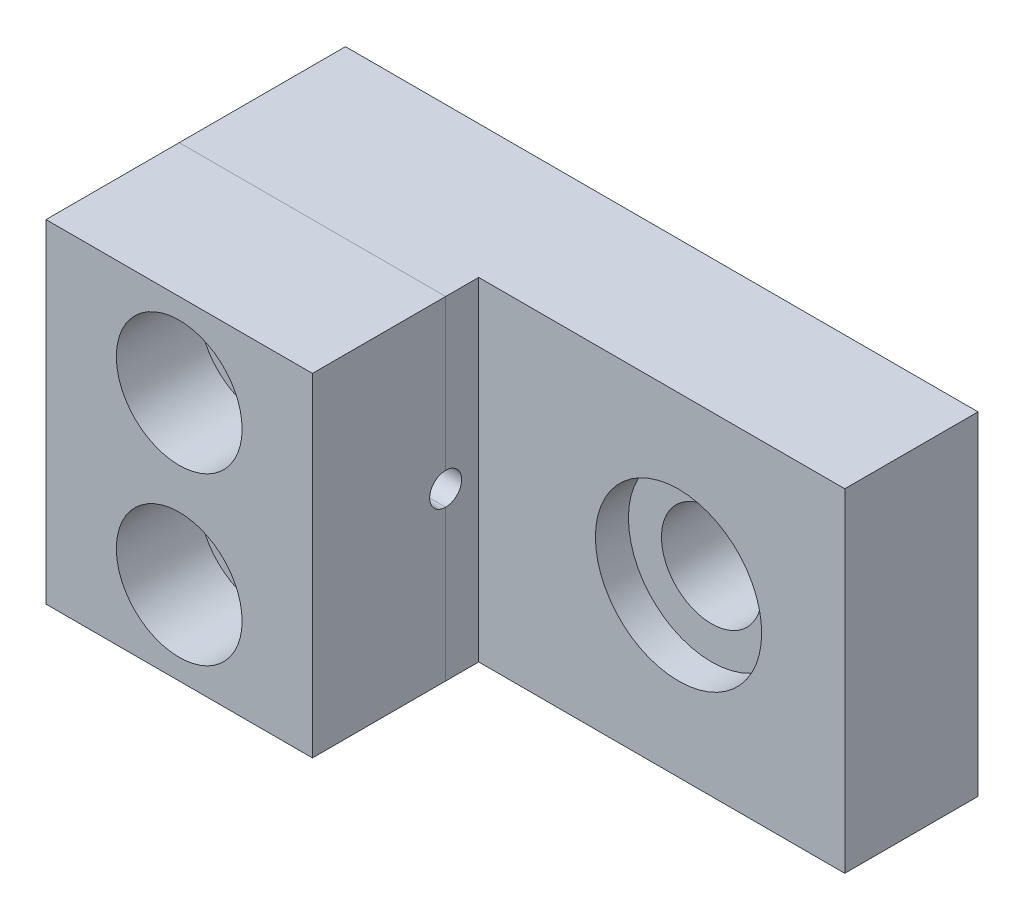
ISO-10303-21;
HEADER;
FILE_DESCRIPTION(('STEP AP214'),'2;1');
FILE_NAME('part.step','',(''),(''),'','','');
FILE_SCHEMA(('AUTOMOTIVE_DESIGN { 1 0 10303 214 1 1 1 1 }'));
ENDSEC;
DATA;
#1=APPLICATION_CONTEXT('core data for automotive mechanical design processes');
#2=APPLICATION_PROTOCOL_DEFINITION('international standard','automotive_design',2000,#1);
#3=PRODUCT_CONTEXT('',#1,'mechanical');
#4=PRODUCT('Part','Part','',(#3));
#5=PRODUCT_RELATED_PRODUCT_CATEGORY('part','',(#4));
#6=PRODUCT_DEFINITION_FORMATION('','',#4);
#7=PRODUCT_DEFINITION_CONTEXT('part definition',#1,'design');
#8=PRODUCT_DEFINITION('design','',#6,#7);
#9=PRODUCT_DEFINITION_SHAPE('','',#8);
#10=(LENGTH_UNIT() NAMED_UNIT(*) SI_UNIT(.MILLI.,.METRE.));
#11=(NAMED_UNIT(*) PLANE_ANGLE_UNIT() SI_UNIT($,.RADIAN.));
#12=(NAMED_UNIT(*) SI_UNIT($,.STERADIAN.) SOLID_ANGLE_UNIT());
#13=UNCERTAINTY_MEASURE_WITH_UNIT(LENGTH_MEASURE(1.E-05),#10,'distance_accuracy_value','');
#14=(GEOMETRIC_REPRESENTATION_CONTEXT(3) GLOBAL_UNCERTAINTY_ASSIGNED_CONTEXT((#13)) GLOBAL_UNIT_ASSIGNED_CONTEXT((#10,
#11,#12)) REPRESENTATION_CONTEXT('',''));
#15=CARTESIAN_POINT('',(0.,0.,0.));
#16=DIRECTION('',(0.,0.,1.));
#17=DIRECTION('',(1.,0.,0.));
#18=AXIS2_PLACEMENT_3D('',#15,#16,#17);
#19=CARTESIAN_POINT('',(-15.875,-3.9624,14.2748));
#20=DIRECTION('',(0.,0.,-1.));
#21=DIRECTION('',(-1.,0.,0.));
#22=AXIS2_PLACEMENT_3D('',#19,#20,#21);
#23=CYLINDRICAL_SURFACE('',#22,1.7272);
#24=CARTESIAN_POINT('',(-15.875,-3.9624,7.9248));
#25=DIRECTION('',(0.,0.,1.));
#26=DIRECTION('',(1.,0.,0.));
#27=AXIS2_PLACEMENT_3D('',#24,#25,#26);
#28=CIRCLE('',#27,1.7272);
#29=CARTESIAN_POINT('',(-14.1478,-3.9624,7.9248));
#30=VERTEX_POINT('',#29);
#31=EDGE_CURVE('E155',#30,#30,#28,.T.);
#32=ORIENTED_EDGE('',*,*,#31,.F.);
#33=EDGE_LOOP('',(#32));
#34=FACE_BOUND('',#33,.T.);
#35=CARTESIAN_POINT('',(-15.875,-3.9624,10.3124));
#36=DIRECTION('',(0.,0.,1.));
#37=DIRECTION('',(1.,0.,0.));
#38=AXIS2_PLACEMENT_3D('',#35,#36,#37);
#39=CIRCLE('',#38,1.7272);
#40=CARTESIAN_POINT('',(-14.1478,-3.9624,10.3124));
#41=VERTEX_POINT('',#40);
#42=EDGE_CURVE('E47',#41,#41,#39,.T.);
#43=ORIENTED_EDGE('',*,*,#42,.T.);
#44=EDGE_LOOP('',(#43));
#45=FACE_BOUND('',#44,.T.);
#46=ADVANCED_FACE('F43',(#34,#45),#23,.F.);
#47=CARTESIAN_POINT('',(-15.875,3.9624,14.2748));
#48=DIRECTION('',(0.,0.,-1.));
#49=DIRECTION('',(-1.,0.,0.));
#50=AXIS2_PLACEMENT_3D('',#47,#48,#49);
#51=CYLINDRICAL_SURFACE('',#50,1.7272);
#52=CARTESIAN_POINT('',(-15.875,3.9624,7.9248));
#53=DIRECTION('',(0.,0.,1.));
#54=DIRECTION('',(1.,0.,0.));
#55=AXIS2_PLACEMENT_3D('',#52,#53,#54);
#56=CIRCLE('',#55,1.7272);
#57=CARTESIAN_POINT('',(-14.1478,3.9624,7.9248));
#58=VERTEX_POINT('',#57);
#59=EDGE_CURVE('E119',#58,#58,#56,.T.);
#60=ORIENTED_EDGE('',*,*,#59,.F.);
#61=EDGE_LOOP('',(#60));
#62=FACE_BOUND('',#61,.T.);
#63=CARTESIAN_POINT('',(-15.875,3.9624,10.3124));
#64=DIRECTION('',(0.,0.,1.));
#65=DIRECTION('',(1.,0.,0.));
#66=AXIS2_PLACEMENT_3D('',#63,#64,#65);
#67=CIRCLE('',#66,1.7272);
#68=CARTESIAN_POINT('',(-14.1478,3.9624,10.3124));
#69=VERTEX_POINT('',#68);
#70=EDGE_CURVE('E110',#69,#69,#67,.T.);
#71=ORIENTED_EDGE('',*,*,#70,.T.);
#72=EDGE_LOOP('',(#71));
#73=FACE_BOUND('',#72,.T.);
#74=ADVANCED_FACE('F188',(#62,#73),#51,.F.);
#75=CARTESIAN_POINT('',(0.,0.,7.9248));
#76=DIRECTION('',(0.,0.,1.));
#77=DIRECTION('',(1.,0.,0.));
#78=AXIS2_PLACEMENT_3D('',#75,#76,#77);
#79=PLANE('',#78);
#80=ORIENTED_EDGE('',*,*,#59,.T.);
#81=EDGE_LOOP('',(#80));
#82=FACE_BOUND('',#81,.T.);
#83=DIRECTION('',(0.,1.,0.));
#84=VECTOR('',#83,1.);
#85=CARTESIAN_POINT('',(-9.525,-7.9375,7.9248));
#86=LINE('',#85,#84);
#87=CARTESIAN_POINT('',(-9.525,0.761999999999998,7.9248));
#88=VERTEX_POINT('',#87);
#89=CARTESIAN_POINT('',(-9.525,7.93749999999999,7.9248));
#90=VERTEX_POINT('',#89);
#91=EDGE_CURVE('E118',#88,#90,#86,.T.);
#92=ORIENTED_EDGE('',*,*,#91,.F.);
#93=DIRECTION('',(-1.,0.,0.));
#94=VECTOR('',#93,1.);
#95=CARTESIAN_POINT('',(-7.62,0.761999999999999,7.9248));
#96=LINE('',#95,#94);
#97=CARTESIAN_POINT('',(-22.225,0.761999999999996,7.9248));
#98=VERTEX_POINT('',#97);
#99=EDGE_CURVE('E106',#88,#98,#96,.T.);
#100=ORIENTED_EDGE('',*,*,#99,.T.);
#101=DIRECTION('',(0.,-1.,0.));
#102=VECTOR('',#101,1.);
#103=CARTESIAN_POINT('',(-22.225,7.93749999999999,7.9248));
#104=LINE('',#103,#102);
#105=CARTESIAN_POINT('',(-22.225,7.93749999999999,7.9248));
#106=VERTEX_POINT('',#105);
#107=EDGE_CURVE('E117',#106,#98,#104,.T.);
#108=ORIENTED_EDGE('',*,*,#107,.F.);
#109=DIRECTION('',(-1.,0.,0.));
#110=VECTOR('',#109,1.);
#111=CARTESIAN_POINT('',(-9.525,7.93749999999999,7.9248));
#112=LINE('',#111,#110);
#113=EDGE_CURVE('E128',#90,#106,#112,.T.);
#114=ORIENTED_EDGE('',*,*,#113,.F.);
#115=EDGE_LOOP('',(#92,#100,#108,#114));
#116=FACE_BOUND('',#115,.T.);
#117=ADVANCED_FACE('F115',(#82,#116),#79,.F.);
#118=CARTESIAN_POINT('',(0.,0.,14.2748));
#119=DIRECTION('',(0.,0.,1.));
#120=DIRECTION('',(1.,0.,0.));
#121=AXIS2_PLACEMENT_3D('',#118,#119,#120);
#122=PLANE('',#121);
#123=CARTESIAN_POINT('',(-15.875,-3.9624,14.2748));
#124=DIRECTION('',(0.,0.,1.));
#125=DIRECTION('',(1.,0.,0.));
#126=AXIS2_PLACEMENT_3D('',#123,#124,#125);
#127=CIRCLE('',#126,2.9972);
#128=CARTESIAN_POINT('',(-12.8778,-3.9624,14.2748));
#129=VERTEX_POINT('',#128);
#130=EDGE_CURVE('E148',#129,#129,#127,.T.);
#131=ORIENTED_EDGE('',*,*,#130,.F.);
#132=EDGE_LOOP('',(#131));
#133=FACE_BOUND('',#132,.T.);
#134=CARTESIAN_POINT('',(-15.875,3.9624,14.2748));
#135=DIRECTION('',(0.,0.,1.));
#136=DIRECTION('',(1.,0.,0.));
#137=AXIS2_PLACEMENT_3D('',#134,#135,#136);
#138=CIRCLE('',#137,2.9972);
#139=CARTESIAN_POINT('',(-12.8778,3.9624,14.2748));
#140=VERTEX_POINT('',#139);
#141=EDGE_CURVE('E141',#140,#140,#138,.T.);
#142=ORIENTED_EDGE('',*,*,#141,.F.);
#143=EDGE_LOOP('',(#142));
#144=FACE_BOUND('',#143,.T.);
#145=DIRECTION('',(1.,0.,0.));
#146=VECTOR('',#145,1.);
#147=CARTESIAN_POINT('',(-22.225,-7.9375,14.2748));
#148=LINE('',#147,#146);
#149=CARTESIAN_POINT('',(-22.225,-7.9375,14.2748));
#150=VERTEX_POINT('',#149);
#151=CARTESIAN_POINT('',(-9.525,-7.9375,14.2748));
#152=VERTEX_POINT('',#151);
#153=EDGE_CURVE('E125',#150,#152,#148,.T.);
#154=ORIENTED_EDGE('',*,*,#153,.T.);
#155=DIRECTION('',(0.,1.,0.));
#156=VECTOR('',#155,1.);
#157=CARTESIAN_POINT('',(-9.525,-7.9375,14.2748));
#158=LINE('',#157,#156);
#159=CARTESIAN_POINT('',(-9.525,7.93749999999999,14.2748));
#160=VERTEX_POINT('',#159);
#161=EDGE_CURVE('E96',#152,#160,#158,.T.);
#162=ORIENTED_EDGE('',*,*,#161,.T.);
#163=DIRECTION('',(-1.,0.,0.));
#164=VECTOR('',#163,1.);
#165=CARTESIAN_POINT('',(-9.525,7.93749999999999,14.2748));
#166=LINE('',#165,#164);
#167=CARTESIAN_POINT('',(-22.225,7.93749999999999,14.2748));
#168=VERTEX_POINT('',#167);
#169=EDGE_CURVE('E160',#160,#168,#166,.T.);
#170=ORIENTED_EDGE('',*,*,#169,.T.);
#171=DIRECTION('',(0.,-1.,0.));
#172=VECTOR('',#171,1.);
#173=CARTESIAN_POINT('',(-22.225,7.93749999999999,14.2748));
#174=LINE('',#173,#172);
#175=EDGE_CURVE('E69',#168,#150,#174,.T.);
#176=ORIENTED_EDGE('',*,*,#175,.T.);
#177=EDGE_LOOP('',(#154,#162,#170,#176));
#178=FACE_BOUND('',#177,.T.);
#179=ADVANCED_FACE('F170',(#133,#144,#178),#122,.T.);
#180=ORIENTED_EDGE('',*,*,#31,.T.);
#181=EDGE_LOOP('',(#180));
#182=FACE_BOUND('',#181,.T.);
#183=CARTESIAN_POINT('',(-22.225,-0.762000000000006,7.9248));
#184=VERTEX_POINT('',#183);
#185=CARTESIAN_POINT('',(-22.225,-7.9375,7.9248));
#186=VERTEX_POINT('',#185);
#187=EDGE_CURVE('E89',#184,#186,#104,.T.);
#188=ORIENTED_EDGE('',*,*,#187,.F.);
#189=DIRECTION('',(-1.,0.,0.));
#190=VECTOR('',#189,1.);
#191=CARTESIAN_POINT('',(-7.62,-0.762000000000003,7.9248));
#192=LINE('',#191,#190);
#193=CARTESIAN_POINT('',(-9.525,-0.762000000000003,7.9248));
#194=VERTEX_POINT('',#193);
#195=EDGE_CURVE('E60',#184,#194,#192,.F.);
#196=ORIENTED_EDGE('',*,*,#195,.T.);
#197=CARTESIAN_POINT('',(-9.525,-7.9375,7.9248));
#198=VERTEX_POINT('',#197);
#199=EDGE_CURVE('E164',#198,#194,#86,.T.);
#200=ORIENTED_EDGE('',*,*,#199,.F.);
#201=DIRECTION('',(1.,0.,0.));
#202=VECTOR('',#201,1.);
#203=CARTESIAN_POINT('',(-22.225,-7.9375,7.9248));
#204=LINE('',#203,#202);
#205=EDGE_CURVE('E157',#186,#198,#204,.T.);
#206=ORIENTED_EDGE('',*,*,#205,.F.);
#207=EDGE_LOOP('',(#188,#196,#200,#206));
#208=FACE_BOUND('',#207,.T.);
#209=ADVANCED_FACE('F176',(#182,#208),#79,.F.);
#210=CARTESIAN_POINT('',(-22.225,-7.9375,14.2748));
#211=DIRECTION('',(0.,1.,0.));
#212=DIRECTION('',(0.,0.,1.));
#213=AXIS2_PLACEMENT_3D('',#210,#211,#212);
#214=PLANE('',#213);
#215=ORIENTED_EDGE('',*,*,#205,.T.);
#216=DIRECTION('',(0.,0.,-1.));
#217=VECTOR('',#216,1.);
#218=CARTESIAN_POINT('',(-9.525,-7.9375,14.2748));
#219=LINE('',#218,#217);
#220=EDGE_CURVE('E12',#152,#198,#219,.T.);
#221=ORIENTED_EDGE('',*,*,#220,.F.);
#222=ORIENTED_EDGE('',*,*,#153,.F.);
#223=DIRECTION('',(0.,0.,-1.));
#224=VECTOR('',#223,1.);
#225=CARTESIAN_POINT('',(-22.225,-7.9375,14.2748));
#226=LINE('',#225,#224);
#227=EDGE_CURVE('E132',#150,#186,#226,.T.);
#228=ORIENTED_EDGE('',*,*,#227,.T.);
#229=EDGE_LOOP('',(#215,#221,#222,#228));
#230=FACE_BOUND('',#229,.T.);
#231=ADVANCED_FACE('F45',(#230),#214,.F.);
#232=CARTESIAN_POINT('',(-9.525,-7.9375,14.2748));
#233=DIRECTION('',(-1.,0.,0.));
#234=DIRECTION('',(0.,-1.,0.));
#235=AXIS2_PLACEMENT_3D('',#232,#233,#234);
#236=PLANE('',#235);
#237=ORIENTED_EDGE('',*,*,#199,.T.);
#238=CARTESIAN_POINT('',(-9.525,0.,7.9248));
#239=DIRECTION('',(-1.,0.,0.));
#240=DIRECTION('',(0.,-1.,0.));
#241=AXIS2_PLACEMENT_3D('',#238,#239,#240);
#242=CIRCLE('',#241,0.762000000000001);
#243=EDGE_CURVE('E109',#194,#88,#242,.T.);
#244=ORIENTED_EDGE('',*,*,#243,.T.);
#245=ORIENTED_EDGE('',*,*,#91,.T.);
#246=DIRECTION('',(0.,0.,-1.));
#247=VECTOR('',#246,1.);
#248=CARTESIAN_POINT('',(-9.525,7.93749999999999,14.2748));
#249=LINE('',#248,#247);
#250=EDGE_CURVE('E52',#160,#90,#249,.T.);
#251=ORIENTED_EDGE('',*,*,#250,.F.);
#252=ORIENTED_EDGE('',*,*,#161,.F.);
#253=ORIENTED_EDGE('',*,*,#220,.T.);
#254=EDGE_LOOP('',(#237,#244,#245,#251,#252,#253));
#255=FACE_BOUND('',#254,.T.);
#256=ADVANCED_FACE('F166',(#255),#236,.F.);
#257=CARTESIAN_POINT('',(-9.525,7.93749999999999,14.2748));
#258=DIRECTION('',(0.,-1.,0.));
#259=DIRECTION('',(1.,0.,0.));
#260=AXIS2_PLACEMENT_3D('',#257,#258,#259);
#261=PLANE('',#260);
#262=ORIENTED_EDGE('',*,*,#113,.T.);
#263=DIRECTION('',(0.,0.,-1.));
#264=VECTOR('',#263,1.);
#265=CARTESIAN_POINT('',(-22.225,7.93749999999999,14.2748));
#266=LINE('',#265,#264);
#267=EDGE_CURVE('E124',#168,#106,#266,.T.);
#268=ORIENTED_EDGE('',*,*,#267,.F.);
#269=ORIENTED_EDGE('',*,*,#169,.F.);
#270=ORIENTED_EDGE('',*,*,#250,.T.);
#271=EDGE_LOOP('',(#262,#268,#269,#270));
#272=FACE_BOUND('',#271,.T.);
#273=ADVANCED_FACE('F169',(#272),#261,.F.);
#274=CARTESIAN_POINT('',(-22.225,7.93749999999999,14.2748));
#275=DIRECTION('',(1.,0.,0.));
#276=DIRECTION('',(0.,1.,0.));
#277=AXIS2_PLACEMENT_3D('',#274,#275,#276);
#278=PLANE('',#277);
#279=ORIENTED_EDGE('',*,*,#107,.T.);
#280=CARTESIAN_POINT('',(-22.225,0.,7.9248));
#281=DIRECTION('',(-1.,0.,0.));
#282=DIRECTION('',(0.,-1.,0.));
#283=AXIS2_PLACEMENT_3D('',#280,#281,#282);
#284=CIRCLE('',#283,0.762000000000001);
#285=EDGE_CURVE('E103',#184,#98,#284,.T.);
#286=ORIENTED_EDGE('',*,*,#285,.F.);
#287=ORIENTED_EDGE('',*,*,#187,.T.);
#288=ORIENTED_EDGE('',*,*,#227,.F.);
#289=ORIENTED_EDGE('',*,*,#175,.F.);
#290=ORIENTED_EDGE('',*,*,#267,.T.);
#291=EDGE_LOOP('',(#279,#286,#287,#288,#289,#290));
#292=FACE_BOUND('',#291,.T.);
#293=ADVANCED_FACE('F122',(#292),#278,.F.);
#294=CARTESIAN_POINT('',(-7.62,0.,7.9248));
#295=DIRECTION('',(-1.,0.,0.));
#296=DIRECTION('',(0.,-1.,0.));
#297=AXIS2_PLACEMENT_3D('',#294,#295,#296);
#298=CYLINDRICAL_SURFACE('',#297,0.762000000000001);
#299=ORIENTED_EDGE('',*,*,#243,.F.);
#300=ORIENTED_EDGE('',*,*,#195,.F.);
#301=ORIENTED_EDGE('',*,*,#285,.T.);
#302=ORIENTED_EDGE('',*,*,#99,.F.);
#303=EDGE_LOOP('',(#299,#300,#301,#302));
#304=FACE_BOUND('',#303,.T.);
#305=ADVANCED_FACE('F105',(#304),#298,.F.);
#306=CARTESIAN_POINT('',(-15.875,3.9624,10.3124));
#307=DIRECTION('',(0.,0.,1.));
#308=DIRECTION('',(1.,0.,0.));
#309=AXIS2_PLACEMENT_3D('',#306,#307,#308);
#310=CYLINDRICAL_SURFACE('',#309,2.9972);
#311=CARTESIAN_POINT('',(-15.875,3.9624,10.3124));
#312=DIRECTION('',(0.,0.,1.));
#313=DIRECTION('',(1.,0.,0.));
#314=AXIS2_PLACEMENT_3D('',#311,#312,#313);
#315=CIRCLE('',#314,2.9972);
#316=CARTESIAN_POINT('',(-12.8778,3.9624,10.3124));
#317=VERTEX_POINT('',#316);
#318=EDGE_CURVE('E137',#317,#317,#315,.T.);
#319=ORIENTED_EDGE('',*,*,#318,.F.);
#320=EDGE_LOOP('',(#319));
#321=FACE_BOUND('',#320,.T.);
#322=ORIENTED_EDGE('',*,*,#141,.T.);
#323=EDGE_LOOP('',(#322));
#324=FACE_BOUND('',#323,.T.);
#325=ADVANCED_FACE('F203',(#321,#324),#310,.F.);
#326=CARTESIAN_POINT('',(-15.875,3.9624,10.3124));
#327=DIRECTION('',(0.,0.,1.));
#328=DIRECTION('',(1.,0.,0.));
#329=AXIS2_PLACEMENT_3D('',#326,#327,#328);
#330=PLANE('',#329);
#331=ORIENTED_EDGE('',*,*,#70,.F.);
#332=EDGE_LOOP('',(#331));
#333=FACE_BOUND('',#332,.T.);
#334=ORIENTED_EDGE('',*,*,#318,.T.);
#335=EDGE_LOOP('',(#334));
#336=FACE_BOUND('',#335,.T.);
#337=ADVANCED_FACE('F206',(#333,#336),#330,.T.);
#338=CARTESIAN_POINT('',(-15.875,-3.9624,10.3124));
#339=DIRECTION('',(0.,0.,1.));
#340=DIRECTION('',(1.,0.,0.));
#341=AXIS2_PLACEMENT_3D('',#338,#339,#340);
#342=CYLINDRICAL_SURFACE('',#341,2.9972);
#343=CARTESIAN_POINT('',(-15.875,-3.9624,10.3124));
#344=DIRECTION('',(0.,0.,1.));
#345=DIRECTION('',(1.,0.,0.));
#346=AXIS2_PLACEMENT_3D('',#343,#344,#345);
#347=CIRCLE('',#346,2.9972);
#348=CARTESIAN_POINT('',(-12.8778,-3.9624,10.3124));
#349=VERTEX_POINT('',#348);
#350=EDGE_CURVE('E225',#349,#349,#347,.T.);
#351=ORIENTED_EDGE('',*,*,#350,.F.);
#352=EDGE_LOOP('',(#351));
#353=FACE_BOUND('',#352,.T.);
#354=ORIENTED_EDGE('',*,*,#130,.T.);
#355=EDGE_LOOP('',(#354));
#356=FACE_BOUND('',#355,.T.);
#357=ADVANCED_FACE('F210',(#353,#356),#342,.F.);
#358=CARTESIAN_POINT('',(-15.875,-3.9624,10.3124));
#359=DIRECTION('',(0.,0.,1.));
#360=DIRECTION('',(1.,0.,0.));
#361=AXIS2_PLACEMENT_3D('',#358,#359,#360);
#362=PLANE('',#361);
#363=ORIENTED_EDGE('',*,*,#42,.F.);
#364=EDGE_LOOP('',(#363));
#365=FACE_BOUND('',#364,.T.);
#366=ORIENTED_EDGE('',*,*,#350,.T.);
#367=EDGE_LOOP('',(#366));
#368=FACE_BOUND('',#367,.T.);
#369=ADVANCED_FACE('F214',(#365,#368),#362,.T.);
#370=CLOSED_SHELL('',(#46,#74,#117,#179,#209,#231,#256,#273,#293,#305,#325,#337,#357,#369));
#371=MANIFOLD_SOLID_BREP('B2',#370);
#372=CARTESIAN_POINT('',(0.,0.,6.35));
#373=DIRECTION('',(0.,0.,-1.));
#374=DIRECTION('',(-1.,0.,0.));
#375=AXIS2_PLACEMENT_3D('',#372,#373,#374);
#376=CYLINDRICAL_SURFACE('',#375,2.3876);
#377=CARTESIAN_POINT('',(0.,0.,0.));
#378=DIRECTION('',(0.,0.,1.));
#379=DIRECTION('',(1.,0.,0.));
#380=AXIS2_PLACEMENT_3D('',#377,#378,#379);
#381=CIRCLE('',#380,2.3876);
#382=CARTESIAN_POINT('',(2.3876,0.,0.));
#383=VERTEX_POINT('',#382);
#384=EDGE_CURVE('E430',#383,#383,#381,.T.);
#385=ORIENTED_EDGE('',*,*,#384,.F.);
#386=EDGE_LOOP('',(#385));
#387=FACE_BOUND('',#386,.T.);
#388=CARTESIAN_POINT('',(0.,0.,4.7752));
#389=DIRECTION('',(0.,0.,1.));
#390=DIRECTION('',(1.,0.,0.));
#391=AXIS2_PLACEMENT_3D('',#388,#389,#390);
#392=CIRCLE('',#391,2.3876);
#393=CARTESIAN_POINT('',(2.3876,0.,4.7752));
#394=VERTEX_POINT('',#393);
#395=EDGE_CURVE('E322',#394,#394,#392,.T.);
#396=ORIENTED_EDGE('',*,*,#395,.T.);
#397=EDGE_LOOP('',(#396));
#398=FACE_BOUND('',#397,.T.);
#399=ADVANCED_FACE('F318',(#387,#398),#376,.F.);
#400=CARTESIAN_POINT('',(0.,0.,7.9248));
#401=DIRECTION('',(0.,0.,1.));
#402=DIRECTION('',(1.,0.,0.));
#403=AXIS2_PLACEMENT_3D('',#400,#401,#402);
#404=PLANE('',#403);
#405=DIRECTION('',(-1.,0.,0.));
#406=VECTOR('',#405,1.);
#407=CARTESIAN_POINT('',(-7.62,0.761999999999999,7.9248));
#408=LINE('',#407,#406);
#409=CARTESIAN_POINT('',(-9.525,0.761999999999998,7.9248));
#410=VERTEX_POINT('',#409);
#411=CARTESIAN_POINT('',(-22.225,0.761999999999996,7.9248));
#412=VERTEX_POINT('',#411);
#413=EDGE_CURVE('E384',#410,#412,#408,.T.);
#414=ORIENTED_EDGE('',*,*,#413,.F.);
#415=DIRECTION('',(0.,1.,0.));
#416=VECTOR('',#415,1.);
#417=CARTESIAN_POINT('',(-9.525,7.93749999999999,7.9248));
#418=LINE('',#417,#416);
#419=CARTESIAN_POINT('',(-9.525,7.93749999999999,7.9248));
#420=VERTEX_POINT('',#419);
#421=EDGE_CURVE('E412',#410,#420,#418,.T.);
#422=ORIENTED_EDGE('',*,*,#421,.T.);
#423=DIRECTION('',(-1.,0.,0.));
#424=VECTOR('',#423,1.);
#425=CARTESIAN_POINT('',(-9.525,7.93749999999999,7.9248));
#426=LINE('',#425,#424);
#427=CARTESIAN_POINT('',(-22.225,7.93749999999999,7.9248));
#428=VERTEX_POINT('',#427);
#429=EDGE_CURVE('E414',#420,#428,#426,.T.);
#430=ORIENTED_EDGE('',*,*,#429,.T.);
#431=DIRECTION('',(0.,-1.,0.));
#432=VECTOR('',#431,1.);
#433=CARTESIAN_POINT('',(-22.225,7.93749999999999,7.9248));
#434=LINE('',#433,#432);
#435=EDGE_CURVE('E402',#428,#412,#434,.T.);
#436=ORIENTED_EDGE('',*,*,#435,.T.);
#437=EDGE_LOOP('',(#414,#422,#430,#436));
#438=FACE_BOUND('',#437,.T.);
#439=CARTESIAN_POINT('',(-15.875,3.9624,7.9248));
#440=DIRECTION('',(0.,0.,1.));
#441=DIRECTION('',(1.,0.,0.));
#442=AXIS2_PLACEMENT_3D('',#439,#440,#441);
#443=CIRCLE('',#442,1.7272);
#444=CARTESIAN_POINT('',(-14.1478,3.9624,7.9248));
#445=VERTEX_POINT('',#444);
#446=EDGE_CURVE('E407',#445,#445,#443,.T.);
#447=ORIENTED_EDGE('',*,*,#446,.F.);
#448=EDGE_LOOP('',(#447));
#449=FACE_BOUND('',#448,.T.);
#450=ADVANCED_FACE('F480',(#438,#449),#404,.T.);
#451=CARTESIAN_POINT('',(0.,0.,6.35));
#452=DIRECTION('',(0.,0.,1.));
#453=DIRECTION('',(1.,0.,0.));
#454=AXIS2_PLACEMENT_3D('',#451,#452,#453);
#455=PLANE('',#454);
#456=CARTESIAN_POINT('',(0.,0.,6.35));
#457=DIRECTION('',(0.,0.,1.));
#458=DIRECTION('',(1.,0.,0.));
#459=AXIS2_PLACEMENT_3D('',#456,#457,#458);
#460=CIRCLE('',#459,3.9624);
#461=CARTESIAN_POINT('',(3.9624,0.,6.35));
#462=VERTEX_POINT('',#461);
#463=EDGE_CURVE('E485',#462,#462,#460,.T.);
#464=ORIENTED_EDGE('',*,*,#463,.F.);
#465=EDGE_LOOP('',(#464));
#466=FACE_BOUND('',#465,.T.);
#467=DIRECTION('',(-1.,0.,0.));
#468=VECTOR('',#467,1.);
#469=CARTESIAN_POINT('',(7.9248,7.9375,6.35));
#470=LINE('',#469,#468);
#471=CARTESIAN_POINT('',(7.9248,7.9375,6.35));
#472=VERTEX_POINT('',#471);
#473=CARTESIAN_POINT('',(-9.525,7.9375,6.35));
#474=VERTEX_POINT('',#473);
#475=EDGE_CURVE('E439',#472,#474,#470,.T.);
#476=ORIENTED_EDGE('',*,*,#475,.T.);
#477=DIRECTION('',(0.,-1.,0.));
#478=VECTOR('',#477,1.);
#479=CARTESIAN_POINT('',(-9.525,0.,6.35));
#480=LINE('',#479,#478);
#481=CARTESIAN_POINT('',(-9.525,-7.9375,6.35));
#482=VERTEX_POINT('',#481);
#483=EDGE_CURVE('E341',#474,#482,#480,.T.);
#484=ORIENTED_EDGE('',*,*,#483,.T.);
#485=DIRECTION('',(1.,0.,0.));
#486=VECTOR('',#485,1.);
#487=CARTESIAN_POINT('',(-22.225,-7.9375,6.35));
#488=LINE('',#487,#486);
#489=CARTESIAN_POINT('',(7.9248,-7.9375,6.35));
#490=VERTEX_POINT('',#489);
#491=EDGE_CURVE('E434',#482,#490,#488,.T.);
#492=ORIENTED_EDGE('',*,*,#491,.T.);
#493=DIRECTION('',(0.,1.,0.));
#494=VECTOR('',#493,1.);
#495=CARTESIAN_POINT('',(7.9248,-7.9375,6.35));
#496=LINE('',#495,#494);
#497=EDGE_CURVE('E436',#490,#472,#496,.T.);
#498=ORIENTED_EDGE('',*,*,#497,.T.);
#499=EDGE_LOOP('',(#476,#484,#492,#498));
#500=FACE_BOUND('',#499,.T.);
#501=ADVANCED_FACE('F475',(#466,#500),#455,.T.);
#502=CARTESIAN_POINT('',(0.,0.,0.));
#503=DIRECTION('',(0.,0.,1.));
#504=DIRECTION('',(1.,0.,0.));
#505=AXIS2_PLACEMENT_3D('',#502,#503,#504);
#506=PLANE('',#505);
#507=CARTESIAN_POINT('',(-15.875,-3.9624,0.));
#508=DIRECTION('',(0.,0.,1.));
#509=DIRECTION('',(1.,0.,0.));
#510=AXIS2_PLACEMENT_3D('',#507,#508,#509);
#511=CIRCLE('',#510,1.7272);
#512=CARTESIAN_POINT('',(-14.1478,-3.9624,0.));
#513=VERTEX_POINT('',#512);
#514=EDGE_CURVE('E427',#513,#513,#511,.T.);
#515=ORIENTED_EDGE('',*,*,#514,.T.);
#516=EDGE_LOOP('',(#515));
#517=FACE_BOUND('',#516,.T.);
#518=DIRECTION('',(0.,-1.,0.));
#519=VECTOR('',#518,1.);
#520=CARTESIAN_POINT('',(-22.225,7.93749999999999,0.));
#521=LINE('',#520,#519);
#522=CARTESIAN_POINT('',(-22.225,7.93749999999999,0.));
#523=VERTEX_POINT('',#522);
#524=CARTESIAN_POINT('',(-22.225,-7.9375,0.));
#525=VERTEX_POINT('',#524);
#526=EDGE_CURVE('E433',#523,#525,#521,.T.);
#527=ORIENTED_EDGE('',*,*,#526,.F.);
#528=DIRECTION('',(-1.,0.,0.));
#529=VECTOR('',#528,1.);
#530=CARTESIAN_POINT('',(7.9248,7.9375,0.));
#531=LINE('',#530,#529);
#532=CARTESIAN_POINT('',(7.9248,7.9375,0.));
#533=VERTEX_POINT('',#532);
#534=EDGE_CURVE('E437',#533,#523,#531,.T.);
#535=ORIENTED_EDGE('',*,*,#534,.F.);
#536=DIRECTION('',(0.,1.,0.));
#537=VECTOR('',#536,1.);
#538=CARTESIAN_POINT('',(7.9248,-7.9375,0.));
#539=LINE('',#538,#537);
#540=CARTESIAN_POINT('',(7.9248,-7.9375,0.));
#541=VERTEX_POINT('',#540);
#542=EDGE_CURVE('E445',#541,#533,#539,.T.);
#543=ORIENTED_EDGE('',*,*,#542,.F.);
#544=DIRECTION('',(1.,0.,0.));
#545=VECTOR('',#544,1.);
#546=CARTESIAN_POINT('',(-22.225,-7.9375,0.));
#547=LINE('',#546,#545);
#548=EDGE_CURVE('E443',#525,#541,#547,.T.);
#549=ORIENTED_EDGE('',*,*,#548,.F.);
#550=EDGE_LOOP('',(#527,#535,#543,#549));
#551=FACE_BOUND('',#550,.T.);
#552=CARTESIAN_POINT('',(-15.875,3.9624,0.));
#553=DIRECTION('',(0.,0.,1.));
#554=DIRECTION('',(1.,0.,0.));
#555=AXIS2_PLACEMENT_3D('',#552,#553,#554);
#556=CIRCLE('',#555,1.7272);
#557=CARTESIAN_POINT('',(-14.1478,3.9624,0.));
#558=VERTEX_POINT('',#557);
#559=EDGE_CURVE('E424',#558,#558,#556,.T.);
#560=ORIENTED_EDGE('',*,*,#559,.T.);
#561=EDGE_LOOP('',(#560));
#562=FACE_BOUND('',#561,.T.);
#563=ORIENTED_EDGE('',*,*,#384,.T.);
#564=EDGE_LOOP('',(#563));
#565=FACE_BOUND('',#564,.T.);
#566=ADVANCED_FACE('F463',(#517,#551,#562,#565),#506,.F.);
#567=CARTESIAN_POINT('',(-22.225,7.93749999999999,6.35));
#568=DIRECTION('',(1.,0.,0.));
#569=DIRECTION('',(0.,1.,0.));
#570=AXIS2_PLACEMENT_3D('',#567,#568,#569);
#571=PLANE('',#570);
#572=CARTESIAN_POINT('',(-22.225,-0.762000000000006,7.9248));
#573=VERTEX_POINT('',#572);
#574=CARTESIAN_POINT('',(-22.225,-7.9375,7.9248));
#575=VERTEX_POINT('',#574);
#576=EDGE_CURVE('E394',#573,#575,#434,.T.);
#577=ORIENTED_EDGE('',*,*,#576,.F.);
#578=CARTESIAN_POINT('',(-22.225,0.,7.9248));
#579=DIRECTION('',(-1.,0.,0.));
#580=DIRECTION('',(0.,-1.,0.));
#581=AXIS2_PLACEMENT_3D('',#578,#579,#580);
#582=CIRCLE('',#581,0.762000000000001);
#583=EDGE_CURVE('E381',#412,#573,#582,.T.);
#584=ORIENTED_EDGE('',*,*,#583,.F.);
#585=ORIENTED_EDGE('',*,*,#435,.F.);
#586=DIRECTION('',(0.,0.,-1.));
#587=VECTOR('',#586,1.);
#588=CARTESIAN_POINT('',(-22.225,7.93749999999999,6.35));
#589=LINE('',#588,#587);
#590=EDGE_CURVE('E441',#428,#523,#589,.T.);
#591=ORIENTED_EDGE('',*,*,#590,.T.);
#592=ORIENTED_EDGE('',*,*,#526,.T.);
#593=DIRECTION('',(0.,0.,-1.));
#594=VECTOR('',#593,1.);
#595=CARTESIAN_POINT('',(-22.225,-7.9375,6.35));
#596=LINE('',#595,#594);
#597=EDGE_CURVE('E327',#575,#525,#596,.T.);
#598=ORIENTED_EDGE('',*,*,#597,.F.);
#599=EDGE_LOOP('',(#577,#584,#585,#591,#592,#598));
#600=FACE_BOUND('',#599,.T.);
#601=ADVANCED_FACE('F320',(#600),#571,.F.);
#602=CARTESIAN_POINT('',(-22.225,-7.9375,6.35));
#603=DIRECTION('',(0.,1.,0.));
#604=DIRECTION('',(0.,0.,1.));
#605=AXIS2_PLACEMENT_3D('',#602,#603,#604);
#606=PLANE('',#605);
#607=ORIENTED_EDGE('',*,*,#548,.T.);
#608=DIRECTION('',(0.,0.,-1.));
#609=VECTOR('',#608,1.);
#610=CARTESIAN_POINT('',(7.9248,-7.9375,6.35));
#611=LINE('',#610,#609);
#612=EDGE_CURVE('E453',#490,#541,#611,.T.);
#613=ORIENTED_EDGE('',*,*,#612,.F.);
#614=ORIENTED_EDGE('',*,*,#491,.F.);
#615=DIRECTION('',(0.,0.,-1.));
#616=VECTOR('',#615,1.);
#617=CARTESIAN_POINT('',(-9.525,-7.9375,7.9248));
#618=LINE('',#617,#616);
#619=CARTESIAN_POINT('',(-9.525,-7.9375,7.9248));
#620=VERTEX_POINT('',#619);
#621=EDGE_CURVE('E420',#620,#482,#618,.T.);
#622=ORIENTED_EDGE('',*,*,#621,.F.);
#623=DIRECTION('',(1.,0.,0.));
#624=VECTOR('',#623,1.);
#625=CARTESIAN_POINT('',(-22.225,-7.9375,7.9248));
#626=LINE('',#625,#624);
#627=EDGE_CURVE('E405',#575,#620,#626,.T.);
#628=ORIENTED_EDGE('',*,*,#627,.F.);
#629=ORIENTED_EDGE('',*,*,#597,.T.);
#630=EDGE_LOOP('',(#607,#613,#614,#622,#628,#629));
#631=FACE_BOUND('',#630,.T.);
#632=ADVANCED_FACE('F457',(#631),#606,.F.);
#633=CARTESIAN_POINT('',(7.9248,-7.9375,6.35));
#634=DIRECTION('',(-1.,0.,0.));
#635=DIRECTION('',(0.,-1.,0.));
#636=AXIS2_PLACEMENT_3D('',#633,#634,#635);
#637=PLANE('',#636);
#638=ORIENTED_EDGE('',*,*,#542,.T.);
#639=DIRECTION('',(0.,0.,-1.));
#640=VECTOR('',#639,1.);
#641=CARTESIAN_POINT('',(7.9248,7.9375,6.35));
#642=LINE('',#641,#640);
#643=EDGE_CURVE('E450',#472,#533,#642,.T.);
#644=ORIENTED_EDGE('',*,*,#643,.F.);
#645=ORIENTED_EDGE('',*,*,#497,.F.);
#646=ORIENTED_EDGE('',*,*,#612,.T.);
#647=EDGE_LOOP('',(#638,#644,#645,#646));
#648=FACE_BOUND('',#647,.T.);
#649=ADVANCED_FACE('F468',(#648),#637,.F.);
#650=CARTESIAN_POINT('',(7.9248,7.9375,6.35));
#651=DIRECTION('',(0.,-1.,0.));
#652=DIRECTION('',(1.,0.,0.));
#653=AXIS2_PLACEMENT_3D('',#650,#651,#652);
#654=PLANE('',#653);
#655=ORIENTED_EDGE('',*,*,#590,.F.);
#656=ORIENTED_EDGE('',*,*,#429,.F.);
#657=DIRECTION('',(0.,0.,-1.));
#658=VECTOR('',#657,1.);
#659=CARTESIAN_POINT('',(-9.525,7.93749999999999,7.9248));
#660=LINE('',#659,#658);
#661=EDGE_CURVE('E417',#420,#474,#660,.T.);
#662=ORIENTED_EDGE('',*,*,#661,.T.);
#663=ORIENTED_EDGE('',*,*,#475,.F.);
#664=ORIENTED_EDGE('',*,*,#643,.T.);
#665=ORIENTED_EDGE('',*,*,#534,.T.);
#666=EDGE_LOOP('',(#655,#656,#662,#663,#664,#665));
#667=FACE_BOUND('',#666,.T.);
#668=ADVANCED_FACE('F472',(#667),#654,.F.);
#669=CARTESIAN_POINT('',(-15.875,-3.9624,6.35));
#670=DIRECTION('',(0.,0.,-1.));
#671=DIRECTION('',(-1.,0.,0.));
#672=AXIS2_PLACEMENT_3D('',#669,#670,#671);
#673=CYLINDRICAL_SURFACE('',#672,1.7272);
#674=ORIENTED_EDGE('',*,*,#514,.F.);
#675=EDGE_LOOP('',(#674));
#676=FACE_BOUND('',#675,.T.);
#677=CARTESIAN_POINT('',(-15.875,-3.9624,7.9248));
#678=DIRECTION('',(0.,0.,1.));
#679=DIRECTION('',(1.,0.,0.));
#680=AXIS2_PLACEMENT_3D('',#677,#678,#679);
#681=CIRCLE('',#680,1.7272);
#682=CARTESIAN_POINT('',(-14.1478,-3.9624,7.9248));
#683=VERTEX_POINT('',#682);
#684=EDGE_CURVE('E403',#683,#683,#681,.T.);
#685=ORIENTED_EDGE('',*,*,#684,.T.);
#686=EDGE_LOOP('',(#685));
#687=FACE_BOUND('',#686,.T.);
#688=ADVANCED_FACE('F515',(#676,#687),#673,.F.);
#689=CARTESIAN_POINT('',(-15.875,3.9624,6.35));
#690=DIRECTION('',(0.,0.,-1.));
#691=DIRECTION('',(-1.,0.,0.));
#692=AXIS2_PLACEMENT_3D('',#689,#690,#691);
#693=CYLINDRICAL_SURFACE('',#692,1.7272);
#694=ORIENTED_EDGE('',*,*,#559,.F.);
#695=EDGE_LOOP('',(#694));
#696=FACE_BOUND('',#695,.T.);
#697=ORIENTED_EDGE('',*,*,#446,.T.);
#698=EDGE_LOOP('',(#697));
#699=FACE_BOUND('',#698,.T.);
#700=ADVANCED_FACE('F554',(#696,#699),#693,.F.);
#701=DIRECTION('',(-1.,0.,0.));
#702=VECTOR('',#701,1.);
#703=CARTESIAN_POINT('',(-7.62,-0.762000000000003,7.9248));
#704=LINE('',#703,#702);
#705=CARTESIAN_POINT('',(-9.525,-0.762000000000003,7.9248));
#706=VERTEX_POINT('',#705);
#707=EDGE_CURVE('E334',#573,#706,#704,.F.);
#708=ORIENTED_EDGE('',*,*,#707,.F.);
#709=ORIENTED_EDGE('',*,*,#576,.T.);
#710=ORIENTED_EDGE('',*,*,#627,.T.);
#711=EDGE_CURVE('E397',#620,#706,#418,.T.);
#712=ORIENTED_EDGE('',*,*,#711,.T.);
#713=EDGE_LOOP('',(#708,#709,#710,#712));
#714=FACE_BOUND('',#713,.T.);
#715=ORIENTED_EDGE('',*,*,#684,.F.);
#716=EDGE_LOOP('',(#715));
#717=FACE_BOUND('',#716,.T.);
#718=ADVANCED_FACE('F392',(#714,#717),#404,.T.);
#719=CARTESIAN_POINT('',(-9.525,7.93749999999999,7.9248));
#720=DIRECTION('',(-1.,0.,0.));
#721=DIRECTION('',(0.,-1.,0.));
#722=AXIS2_PLACEMENT_3D('',#719,#720,#721);
#723=PLANE('',#722);
#724=ORIENTED_EDGE('',*,*,#421,.F.);
#725=CARTESIAN_POINT('',(-9.525,0.,7.9248));
#726=DIRECTION('',(-1.,0.,0.));
#727=DIRECTION('',(0.,-1.,0.));
#728=AXIS2_PLACEMENT_3D('',#725,#726,#727);
#729=CIRCLE('',#728,0.762000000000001);
#730=EDGE_CURVE('E41',#410,#706,#729,.T.);
#731=ORIENTED_EDGE('',*,*,#730,.T.);
#732=ORIENTED_EDGE('',*,*,#711,.F.);
#733=ORIENTED_EDGE('',*,*,#621,.T.);
#734=ORIENTED_EDGE('',*,*,#483,.F.);
#735=ORIENTED_EDGE('',*,*,#661,.F.);
#736=EDGE_LOOP('',(#724,#731,#732,#733,#734,#735));
#737=FACE_BOUND('',#736,.T.);
#738=ADVANCED_FACE('F478',(#737),#723,.F.);
#739=CARTESIAN_POINT('',(-7.62,0.,7.9248));
#740=DIRECTION('',(-1.,0.,0.));
#741=DIRECTION('',(0.,-1.,0.));
#742=AXIS2_PLACEMENT_3D('',#739,#740,#741);
#743=CYLINDRICAL_SURFACE('',#742,0.762000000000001);
#744=ORIENTED_EDGE('',*,*,#413,.T.);
#745=ORIENTED_EDGE('',*,*,#583,.T.);
#746=ORIENTED_EDGE('',*,*,#707,.T.);
#747=ORIENTED_EDGE('',*,*,#730,.F.);
#748=EDGE_LOOP('',(#744,#745,#746,#747));
#749=FACE_BOUND('',#748,.T.);
#750=ADVANCED_FACE('F382',(#749),#743,.F.);
#751=CARTESIAN_POINT('',(0.,0.,4.7752));
#752=DIRECTION('',(0.,0.,1.));
#753=DIRECTION('',(1.,0.,0.));
#754=AXIS2_PLACEMENT_3D('',#751,#752,#753);
#755=CYLINDRICAL_SURFACE('',#754,3.9624);
#756=CARTESIAN_POINT('',(0.,0.,4.7752));
#757=DIRECTION('',(0.,0.,1.));
#758=DIRECTION('',(1.,0.,0.));
#759=AXIS2_PLACEMENT_3D('',#756,#757,#758);
#760=CIRCLE('',#759,3.9624);
#761=CARTESIAN_POINT('',(3.9624,0.,4.7752));
#762=VERTEX_POINT('',#761);
#763=EDGE_CURVE('E488',#762,#762,#760,.T.);
#764=ORIENTED_EDGE('',*,*,#763,.F.);
#765=EDGE_LOOP('',(#764));
#766=FACE_BOUND('',#765,.T.);
#767=ORIENTED_EDGE('',*,*,#463,.T.);
#768=EDGE_LOOP('',(#767));
#769=FACE_BOUND('',#768,.T.);
#770=ADVANCED_FACE('F498',(#766,#769),#755,.F.);
#771=CARTESIAN_POINT('',(0.,0.,4.7752));
#772=DIRECTION('',(0.,0.,1.));
#773=DIRECTION('',(1.,0.,0.));
#774=AXIS2_PLACEMENT_3D('',#771,#772,#773);
#775=PLANE('',#774);
#776=ORIENTED_EDGE('',*,*,#395,.F.);
#777=EDGE_LOOP('',(#776));
#778=FACE_BOUND('',#777,.T.);
#779=ORIENTED_EDGE('',*,*,#763,.T.);
#780=EDGE_LOOP('',(#779));
#781=FACE_BOUND('',#780,.T.);
#782=ADVANCED_FACE('F496',(#778,#781),#775,.T.);
#783=CLOSED_SHELL('',(#399,#450,#501,#566,#601,#632,#649,#668,#688,#700,#718,#738,#750,#770,#782));
#784=MANIFOLD_SOLID_BREP('B6',#783);
#785=ADVANCED_BREP_SHAPE_REPRESENTATION('',(#18,#371,#784),#14);
#786=SHAPE_DEFINITION_REPRESENTATION(#9,#785);
ENDSEC;
END-ISO-10303-21;
